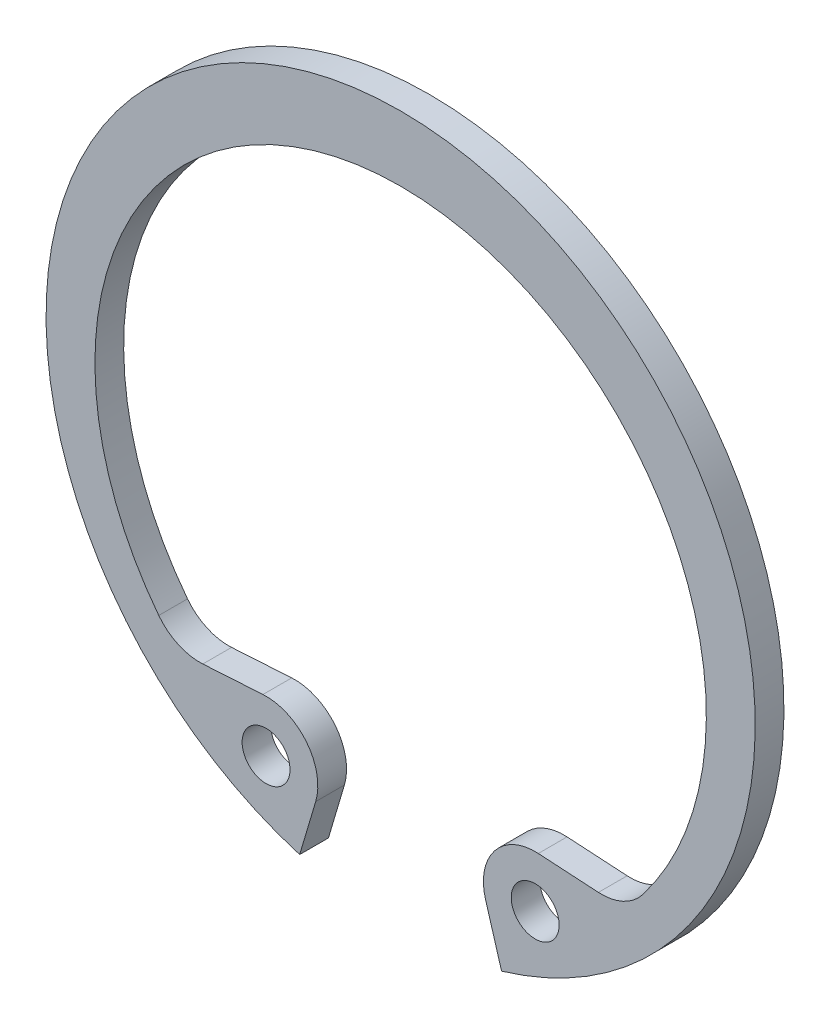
ISO-10303-21;
HEADER;
FILE_DESCRIPTION(('STEP AP214'),'2;1');
FILE_NAME('part.step','',(''),(''),'','','');
FILE_SCHEMA(('AUTOMOTIVE_DESIGN { 1 0 10303 214 1 1 1 1 }'));
ENDSEC;
DATA;
#1=APPLICATION_CONTEXT('core data for automotive mechanical design processes');
#2=APPLICATION_PROTOCOL_DEFINITION('international standard','automotive_design',2000,#1);
#3=PRODUCT_CONTEXT('',#1,'mechanical');
#4=PRODUCT('Part','Part','',(#3));
#5=PRODUCT_RELATED_PRODUCT_CATEGORY('part','',(#4));
#6=PRODUCT_DEFINITION_FORMATION('','',#4);
#7=PRODUCT_DEFINITION_CONTEXT('part definition',#1,'design');
#8=PRODUCT_DEFINITION('design','',#6,#7);
#9=PRODUCT_DEFINITION_SHAPE('','',#8);
#10=(LENGTH_UNIT() NAMED_UNIT(*) SI_UNIT(.MILLI.,.METRE.));
#11=(NAMED_UNIT(*) PLANE_ANGLE_UNIT() SI_UNIT($,.RADIAN.));
#12=(NAMED_UNIT(*) SI_UNIT($,.STERADIAN.) SOLID_ANGLE_UNIT());
#13=UNCERTAINTY_MEASURE_WITH_UNIT(LENGTH_MEASURE(1.E-05),#10,'distance_accuracy_value','');
#14=(GEOMETRIC_REPRESENTATION_CONTEXT(3) GLOBAL_UNCERTAINTY_ASSIGNED_CONTEXT((#13)) GLOBAL_UNIT_ASSIGNED_CONTEXT((#10,
#11,#12)) REPRESENTATION_CONTEXT('',''));
#15=CARTESIAN_POINT('',(0.,0.,0.));
#16=DIRECTION('',(0.,0.,1.));
#17=DIRECTION('',(1.,0.,0.));
#18=AXIS2_PLACEMENT_3D('',#15,#16,#17);
#19=CARTESIAN_POINT('',(0.,0.,1.5));
#20=DIRECTION('',(0.,0.,1.));
#21=DIRECTION('',(1.,0.,0.));
#22=AXIS2_PLACEMENT_3D('',#19,#20,#21);
#23=PLANE('',#22);
#24=CARTESIAN_POINT('',(7.02026616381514,-14.1547116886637,1.5));
#25=DIRECTION('',(0.,0.,1.));
#26=DIRECTION('',(1.,0.,0.));
#27=AXIS2_PLACEMENT_3D('',#24,#25,#26);
#28=CIRCLE('',#27,1.25);
#29=CARTESIAN_POINT('',(8.27026616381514,-14.1547116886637,1.5));
#30=VERTEX_POINT('',#29);
#31=EDGE_CURVE('E128',#30,#30,#28,.T.);
#32=ORIENTED_EDGE('',*,*,#31,.F.);
#33=EDGE_LOOP('',(#32));
#34=FACE_BOUND('',#33,.T.);
#35=CARTESIAN_POINT('',(0.,0.,1.5));
#36=DIRECTION('',(0.,0.,1.));
#37=DIRECTION('',(1.,0.,0.));
#38=AXIS2_PLACEMENT_3D('',#35,#36,#37);
#39=CIRCLE('',#38,18.5);
#40=CARTESIAN_POINT('',(5.26683348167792,-17.7344429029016,1.5));
#41=VERTEX_POINT('',#40);
#42=CARTESIAN_POINT('',(-5.26683348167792,-17.7344429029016,1.5));
#43=VERTEX_POINT('',#42);
#44=EDGE_CURVE('E150',#41,#43,#39,.T.);
#45=ORIENTED_EDGE('',*,*,#44,.T.);
#46=DIRECTION('',(0.284693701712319,0.958618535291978,0.));
#47=VECTOR('',#46,1.);
#48=CARTESIAN_POINT('',(-4.43199611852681,-14.9233846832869,1.5));
#49=LINE('',#48,#47);
#50=CARTESIAN_POINT('',(-4.43199611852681,-14.9233846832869,1.5));
#51=VERTEX_POINT('',#50);
#52=EDGE_CURVE('E123',#43,#51,#49,.T.);
#53=ORIENTED_EDGE('',*,*,#52,.T.);
#54=CARTESIAN_POINT('',(-7.02026616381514,-14.1547116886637,1.5));
#55=DIRECTION('',(0.,0.,1.));
#56=DIRECTION('',(-1.,0.,0.));
#57=AXIS2_PLACEMENT_3D('',#54,#55,#56);
#58=CIRCLE('',#57,2.69999999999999);
#59=CARTESIAN_POINT('',(-7.18319031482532,-11.4596317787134,1.5));
#60=VERTEX_POINT('',#59);
#61=EDGE_CURVE('E153',#51,#60,#58,.T.);
#62=ORIENTED_EDGE('',*,*,#61,.T.);
#63=DIRECTION('',(-0.99817774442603,-0.0603422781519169,0.));
#64=VECTOR('',#63,1.);
#65=CARTESIAN_POINT('',(-10.3196843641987,-11.6492404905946,1.5));
#66=LINE('',#65,#64);
#67=CARTESIAN_POINT('',(-10.3196843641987,-11.6492404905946,1.5));
#68=VERTEX_POINT('',#67);
#69=EDGE_CURVE('E155',#60,#68,#66,.T.);
#70=ORIENTED_EDGE('',*,*,#69,.T.);
#71=CARTESIAN_POINT('',(-10.4826085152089,-8.95416058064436,1.5));
#72=DIRECTION('',(0.,0.,-1.));
#73=DIRECTION('',(-1.,0.,0.));
#74=AXIS2_PLACEMENT_3D('',#71,#72,#73);
#75=CIRCLE('',#74,2.69999999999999);
#76=CARTESIAN_POINT('',(-12.6186872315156,-10.6055744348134,1.5));
#77=VERTEX_POINT('',#76);
#78=EDGE_CURVE('E157',#68,#77,#75,.T.);
#79=ORIENTED_EDGE('',*,*,#78,.T.);
#80=CARTESIAN_POINT('',(0.,-0.85,1.5));
#81=DIRECTION('',(0.,0.,-1.));
#82=DIRECTION('',(1.,0.,0.));
#83=AXIS2_PLACEMENT_3D('',#80,#81,#82);
#84=CIRCLE('',#83,15.95);
#85=CARTESIAN_POINT('',(12.6186872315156,-10.6055744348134,1.5));
#86=VERTEX_POINT('',#85);
#87=EDGE_CURVE('E159',#77,#86,#84,.T.);
#88=ORIENTED_EDGE('',*,*,#87,.T.);
#89=CARTESIAN_POINT('',(10.4826085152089,-8.95416058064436,1.5));
#90=DIRECTION('',(0.,0.,-1.));
#91=DIRECTION('',(1.,0.,0.));
#92=AXIS2_PLACEMENT_3D('',#89,#90,#91);
#93=CIRCLE('',#92,2.69999999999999);
#94=CARTESIAN_POINT('',(10.3196843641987,-11.6492404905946,1.5));
#95=VERTEX_POINT('',#94);
#96=EDGE_CURVE('E161',#86,#95,#93,.T.);
#97=ORIENTED_EDGE('',*,*,#96,.T.);
#98=DIRECTION('',(-0.99817774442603,0.0603422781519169,0.));
#99=VECTOR('',#98,1.);
#100=CARTESIAN_POINT('',(10.3196843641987,-11.6492404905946,1.5));
#101=LINE('',#100,#99);
#102=CARTESIAN_POINT('',(7.18319031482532,-11.4596317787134,1.5));
#103=VERTEX_POINT('',#102);
#104=EDGE_CURVE('E163',#95,#103,#101,.T.);
#105=ORIENTED_EDGE('',*,*,#104,.T.);
#106=CARTESIAN_POINT('',(7.02026616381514,-14.1547116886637,1.5));
#107=DIRECTION('',(0.,0.,1.));
#108=DIRECTION('',(1.,0.,0.));
#109=AXIS2_PLACEMENT_3D('',#106,#107,#108);
#110=CIRCLE('',#109,2.69999999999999);
#111=CARTESIAN_POINT('',(4.43199611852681,-14.9233846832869,1.5));
#112=VERTEX_POINT('',#111);
#113=EDGE_CURVE('E52',#103,#112,#110,.T.);
#114=ORIENTED_EDGE('',*,*,#113,.T.);
#115=DIRECTION('',(0.284693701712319,-0.958618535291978,0.));
#116=VECTOR('',#115,1.);
#117=CARTESIAN_POINT('',(4.43199611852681,-14.9233846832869,1.5));
#118=LINE('',#117,#116);
#119=EDGE_CURVE('E47',#112,#41,#118,.T.);
#120=ORIENTED_EDGE('',*,*,#119,.T.);
#121=EDGE_LOOP('',(#45,#53,#62,#70,#79,#88,#97,#105,#114,#120));
#122=FACE_BOUND('',#121,.T.);
#123=CARTESIAN_POINT('',(-7.02026616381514,-14.1547116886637,1.5));
#124=DIRECTION('',(0.,0.,1.));
#125=DIRECTION('',(-1.,0.,0.));
#126=AXIS2_PLACEMENT_3D('',#123,#124,#125);
#127=CIRCLE('',#126,1.25);
#128=CARTESIAN_POINT('',(-8.27026616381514,-14.1547116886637,1.5));
#129=VERTEX_POINT('',#128);
#130=EDGE_CURVE('E250',#129,#129,#127,.T.);
#131=ORIENTED_EDGE('',*,*,#130,.F.);
#132=EDGE_LOOP('',(#131));
#133=FACE_BOUND('',#132,.T.);
#134=ADVANCED_FACE('F32',(#34,#122,#133),#23,.T.);
#135=CARTESIAN_POINT('',(0.,0.,0.));
#136=DIRECTION('',(0.,0.,1.));
#137=DIRECTION('',(1.,0.,0.));
#138=AXIS2_PLACEMENT_3D('',#135,#136,#137);
#139=PLANE('',#138);
#140=CARTESIAN_POINT('',(7.02026616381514,-14.1547116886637,0.));
#141=DIRECTION('',(0.,0.,1.));
#142=DIRECTION('',(1.,0.,0.));
#143=AXIS2_PLACEMENT_3D('',#140,#141,#142);
#144=CIRCLE('',#143,1.25);
#145=CARTESIAN_POINT('',(8.27026616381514,-14.1547116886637,0.));
#146=VERTEX_POINT('',#145);
#147=EDGE_CURVE('E131',#146,#146,#144,.T.);
#148=ORIENTED_EDGE('',*,*,#147,.T.);
#149=EDGE_LOOP('',(#148));
#150=FACE_BOUND('',#149,.T.);
#151=CARTESIAN_POINT('',(0.,0.,0.));
#152=DIRECTION('',(0.,0.,1.));
#153=DIRECTION('',(1.,0.,0.));
#154=AXIS2_PLACEMENT_3D('',#151,#152,#153);
#155=CIRCLE('',#154,18.5);
#156=CARTESIAN_POINT('',(5.26683348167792,-17.7344429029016,0.));
#157=VERTEX_POINT('',#156);
#158=CARTESIAN_POINT('',(-5.26683348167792,-17.7344429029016,0.));
#159=VERTEX_POINT('',#158);
#160=EDGE_CURVE('E114',#157,#159,#155,.T.);
#161=ORIENTED_EDGE('',*,*,#160,.F.);
#162=DIRECTION('',(0.284693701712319,-0.958618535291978,0.));
#163=VECTOR('',#162,1.);
#164=CARTESIAN_POINT('',(4.43199611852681,-14.9233846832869,0.));
#165=LINE('',#164,#163);
#166=CARTESIAN_POINT('',(4.43199611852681,-14.9233846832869,0.));
#167=VERTEX_POINT('',#166);
#168=EDGE_CURVE('E148',#167,#157,#165,.T.);
#169=ORIENTED_EDGE('',*,*,#168,.F.);
#170=CARTESIAN_POINT('',(7.02026616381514,-14.1547116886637,0.));
#171=DIRECTION('',(0.,0.,1.));
#172=DIRECTION('',(1.,0.,0.));
#173=AXIS2_PLACEMENT_3D('',#170,#171,#172);
#174=CIRCLE('',#173,2.69999999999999);
#175=CARTESIAN_POINT('',(7.18319031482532,-11.4596317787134,0.));
#176=VERTEX_POINT('',#175);
#177=EDGE_CURVE('E146',#176,#167,#174,.T.);
#178=ORIENTED_EDGE('',*,*,#177,.F.);
#179=DIRECTION('',(-0.99817774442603,0.0603422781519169,0.));
#180=VECTOR('',#179,1.);
#181=CARTESIAN_POINT('',(10.3196843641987,-11.6492404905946,0.));
#182=LINE('',#181,#180);
#183=CARTESIAN_POINT('',(10.3196843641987,-11.6492404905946,0.));
#184=VERTEX_POINT('',#183);
#185=EDGE_CURVE('E144',#184,#176,#182,.T.);
#186=ORIENTED_EDGE('',*,*,#185,.F.);
#187=CARTESIAN_POINT('',(10.4826085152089,-8.95416058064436,0.));
#188=DIRECTION('',(0.,0.,-1.));
#189=DIRECTION('',(1.,0.,0.));
#190=AXIS2_PLACEMENT_3D('',#187,#188,#189);
#191=CIRCLE('',#190,2.69999999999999);
#192=CARTESIAN_POINT('',(12.6186872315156,-10.6055744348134,0.));
#193=VERTEX_POINT('',#192);
#194=EDGE_CURVE('E142',#193,#184,#191,.T.);
#195=ORIENTED_EDGE('',*,*,#194,.F.);
#196=CARTESIAN_POINT('',(0.,-0.85,0.));
#197=DIRECTION('',(0.,0.,-1.));
#198=DIRECTION('',(1.,0.,0.));
#199=AXIS2_PLACEMENT_3D('',#196,#197,#198);
#200=CIRCLE('',#199,15.95);
#201=CARTESIAN_POINT('',(-12.6186872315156,-10.6055744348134,0.));
#202=VERTEX_POINT('',#201);
#203=EDGE_CURVE('E140',#202,#193,#200,.T.);
#204=ORIENTED_EDGE('',*,*,#203,.F.);
#205=CARTESIAN_POINT('',(-10.4826085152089,-8.95416058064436,0.));
#206=DIRECTION('',(0.,0.,-1.));
#207=DIRECTION('',(-1.,0.,0.));
#208=AXIS2_PLACEMENT_3D('',#205,#206,#207);
#209=CIRCLE('',#208,2.69999999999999);
#210=CARTESIAN_POINT('',(-10.3196843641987,-11.6492404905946,0.));
#211=VERTEX_POINT('',#210);
#212=EDGE_CURVE('E138',#211,#202,#209,.T.);
#213=ORIENTED_EDGE('',*,*,#212,.F.);
#214=DIRECTION('',(-0.99817774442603,-0.0603422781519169,0.));
#215=VECTOR('',#214,1.);
#216=CARTESIAN_POINT('',(-10.3196843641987,-11.6492404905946,0.));
#217=LINE('',#216,#215);
#218=CARTESIAN_POINT('',(-7.18319031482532,-11.4596317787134,0.));
#219=VERTEX_POINT('',#218);
#220=EDGE_CURVE('E136',#219,#211,#217,.T.);
#221=ORIENTED_EDGE('',*,*,#220,.F.);
#222=CARTESIAN_POINT('',(-7.02026616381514,-14.1547116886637,0.));
#223=DIRECTION('',(0.,0.,1.));
#224=DIRECTION('',(-1.,0.,0.));
#225=AXIS2_PLACEMENT_3D('',#222,#223,#224);
#226=CIRCLE('',#225,2.69999999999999);
#227=CARTESIAN_POINT('',(-4.43199611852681,-14.9233846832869,0.));
#228=VERTEX_POINT('',#227);
#229=EDGE_CURVE('E116',#228,#219,#226,.T.);
#230=ORIENTED_EDGE('',*,*,#229,.F.);
#231=DIRECTION('',(0.284693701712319,0.958618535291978,0.));
#232=VECTOR('',#231,1.);
#233=CARTESIAN_POINT('',(-4.43199611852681,-14.9233846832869,0.));
#234=LINE('',#233,#232);
#235=EDGE_CURVE('E109',#159,#228,#234,.T.);
#236=ORIENTED_EDGE('',*,*,#235,.F.);
#237=EDGE_LOOP('',(#161,#169,#178,#186,#195,#204,#213,#221,#230,#236));
#238=FACE_BOUND('',#237,.T.);
#239=CARTESIAN_POINT('',(-7.02026616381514,-14.1547116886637,0.));
#240=DIRECTION('',(0.,0.,1.));
#241=DIRECTION('',(-1.,0.,0.));
#242=AXIS2_PLACEMENT_3D('',#239,#240,#241);
#243=CIRCLE('',#242,1.25);
#244=CARTESIAN_POINT('',(-8.27026616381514,-14.1547116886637,0.));
#245=VERTEX_POINT('',#244);
#246=EDGE_CURVE('E253',#245,#245,#243,.T.);
#247=ORIENTED_EDGE('',*,*,#246,.T.);
#248=EDGE_LOOP('',(#247));
#249=FACE_BOUND('',#248,.T.);
#250=ADVANCED_FACE('F110',(#150,#238,#249),#139,.F.);
#251=CARTESIAN_POINT('',(0.,0.,1.5));
#252=DIRECTION('',(0.,0.,-1.));
#253=DIRECTION('',(-1.,0.,0.));
#254=AXIS2_PLACEMENT_3D('',#251,#252,#253);
#255=CYLINDRICAL_SURFACE('',#254,18.5);
#256=ORIENTED_EDGE('',*,*,#160,.T.);
#257=DIRECTION('',(0.,0.,-1.));
#258=VECTOR('',#257,1.);
#259=CARTESIAN_POINT('',(-5.26683348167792,-17.7344429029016,1.5));
#260=LINE('',#259,#258);
#261=EDGE_CURVE('E11',#43,#159,#260,.T.);
#262=ORIENTED_EDGE('',*,*,#261,.F.);
#263=ORIENTED_EDGE('',*,*,#44,.F.);
#264=DIRECTION('',(0.,0.,-1.));
#265=VECTOR('',#264,1.);
#266=CARTESIAN_POINT('',(5.26683348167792,-17.7344429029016,1.5));
#267=LINE('',#266,#265);
#268=EDGE_CURVE('E127',#41,#157,#267,.T.);
#269=ORIENTED_EDGE('',*,*,#268,.T.);
#270=EDGE_LOOP('',(#256,#262,#263,#269));
#271=FACE_BOUND('',#270,.T.);
#272=ADVANCED_FACE('F34',(#271),#255,.T.);
#273=CARTESIAN_POINT('',(-4.43199611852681,-14.9233846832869,1.5));
#274=DIRECTION('',(-0.958618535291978,0.284693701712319,0.));
#275=DIRECTION('',(-0.284693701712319,-0.958618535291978,0.));
#276=AXIS2_PLACEMENT_3D('',#273,#274,#275);
#277=PLANE('',#276);
#278=ORIENTED_EDGE('',*,*,#235,.T.);
#279=DIRECTION('',(0.,0.,-1.));
#280=VECTOR('',#279,1.);
#281=CARTESIAN_POINT('',(-4.43199611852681,-14.9233846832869,1.5));
#282=LINE('',#281,#280);
#283=EDGE_CURVE('E40',#51,#228,#282,.T.);
#284=ORIENTED_EDGE('',*,*,#283,.F.);
#285=ORIENTED_EDGE('',*,*,#52,.F.);
#286=ORIENTED_EDGE('',*,*,#261,.T.);
#287=EDGE_LOOP('',(#278,#284,#285,#286));
#288=FACE_BOUND('',#287,.T.);
#289=ADVANCED_FACE('F122',(#288),#277,.F.);
#290=CARTESIAN_POINT('',(-7.02026616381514,-14.1547116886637,1.5));
#291=DIRECTION('',(0.,0.,-1.));
#292=DIRECTION('',(-1.,0.,0.));
#293=AXIS2_PLACEMENT_3D('',#290,#291,#292);
#294=CYLINDRICAL_SURFACE('',#293,2.69999999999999);
#295=ORIENTED_EDGE('',*,*,#229,.T.);
#296=DIRECTION('',(0.,0.,-1.));
#297=VECTOR('',#296,1.);
#298=CARTESIAN_POINT('',(-7.18319031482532,-11.4596317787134,1.5));
#299=LINE('',#298,#297);
#300=EDGE_CURVE('E186',#60,#219,#299,.T.);
#301=ORIENTED_EDGE('',*,*,#300,.F.);
#302=ORIENTED_EDGE('',*,*,#61,.F.);
#303=ORIENTED_EDGE('',*,*,#283,.T.);
#304=EDGE_LOOP('',(#295,#301,#302,#303));
#305=FACE_BOUND('',#304,.T.);
#306=ADVANCED_FACE('F190',(#305),#294,.T.);
#307=CARTESIAN_POINT('',(-10.3196843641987,-11.6492404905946,1.5));
#308=DIRECTION('',(0.0603422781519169,-0.99817774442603,0.));
#309=DIRECTION('',(0.99817774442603,0.0603422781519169,0.));
#310=AXIS2_PLACEMENT_3D('',#307,#308,#309);
#311=PLANE('',#310);
#312=ORIENTED_EDGE('',*,*,#220,.T.);
#313=DIRECTION('',(0.,0.,-1.));
#314=VECTOR('',#313,1.);
#315=CARTESIAN_POINT('',(-10.3196843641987,-11.6492404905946,1.5));
#316=LINE('',#315,#314);
#317=EDGE_CURVE('E183',#68,#211,#316,.T.);
#318=ORIENTED_EDGE('',*,*,#317,.F.);
#319=ORIENTED_EDGE('',*,*,#69,.F.);
#320=ORIENTED_EDGE('',*,*,#300,.T.);
#321=EDGE_LOOP('',(#312,#318,#319,#320));
#322=FACE_BOUND('',#321,.T.);
#323=ADVANCED_FACE('F198',(#322),#311,.F.);
#324=CARTESIAN_POINT('',(-10.4826085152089,-8.95416058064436,1.5));
#325=DIRECTION('',(0.,0.,-1.));
#326=DIRECTION('',(-1.,0.,0.));
#327=AXIS2_PLACEMENT_3D('',#324,#325,#326);
#328=CYLINDRICAL_SURFACE('',#327,2.69999999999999);
#329=ORIENTED_EDGE('',*,*,#212,.T.);
#330=DIRECTION('',(0.,0.,-1.));
#331=VECTOR('',#330,1.);
#332=CARTESIAN_POINT('',(-12.6186872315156,-10.6055744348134,1.5));
#333=LINE('',#332,#331);
#334=EDGE_CURVE('E180',#77,#202,#333,.T.);
#335=ORIENTED_EDGE('',*,*,#334,.F.);
#336=ORIENTED_EDGE('',*,*,#78,.F.);
#337=ORIENTED_EDGE('',*,*,#317,.T.);
#338=EDGE_LOOP('',(#329,#335,#336,#337));
#339=FACE_BOUND('',#338,.T.);
#340=ADVANCED_FACE('F201',(#339),#328,.F.);
#341=CARTESIAN_POINT('',(0.,-0.85,1.5));
#342=DIRECTION('',(0.,0.,-1.));
#343=DIRECTION('',(-1.,0.,0.));
#344=AXIS2_PLACEMENT_3D('',#341,#342,#343);
#345=CYLINDRICAL_SURFACE('',#344,15.95);
#346=ORIENTED_EDGE('',*,*,#203,.T.);
#347=DIRECTION('',(0.,0.,-1.));
#348=VECTOR('',#347,1.);
#349=CARTESIAN_POINT('',(12.6186872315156,-10.6055744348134,1.5));
#350=LINE('',#349,#348);
#351=EDGE_CURVE('E177',#86,#193,#350,.T.);
#352=ORIENTED_EDGE('',*,*,#351,.F.);
#353=ORIENTED_EDGE('',*,*,#87,.F.);
#354=ORIENTED_EDGE('',*,*,#334,.T.);
#355=EDGE_LOOP('',(#346,#352,#353,#354));
#356=FACE_BOUND('',#355,.T.);
#357=ADVANCED_FACE('F206',(#356),#345,.F.);
#358=CARTESIAN_POINT('',(10.4826085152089,-8.95416058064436,1.5));
#359=DIRECTION('',(0.,0.,-1.));
#360=DIRECTION('',(-1.,0.,0.));
#361=AXIS2_PLACEMENT_3D('',#358,#359,#360);
#362=CYLINDRICAL_SURFACE('',#361,2.69999999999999);
#363=ORIENTED_EDGE('',*,*,#194,.T.);
#364=DIRECTION('',(0.,0.,-1.));
#365=VECTOR('',#364,1.);
#366=CARTESIAN_POINT('',(10.3196843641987,-11.6492404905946,1.5));
#367=LINE('',#366,#365);
#368=EDGE_CURVE('E174',#95,#184,#367,.T.);
#369=ORIENTED_EDGE('',*,*,#368,.F.);
#370=ORIENTED_EDGE('',*,*,#96,.F.);
#371=ORIENTED_EDGE('',*,*,#351,.T.);
#372=EDGE_LOOP('',(#363,#369,#370,#371));
#373=FACE_BOUND('',#372,.T.);
#374=ADVANCED_FACE('F212',(#373),#362,.F.);
#375=CARTESIAN_POINT('',(10.3196843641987,-11.6492404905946,1.5));
#376=DIRECTION('',(-0.0603422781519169,-0.99817774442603,0.));
#377=DIRECTION('',(0.99817774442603,-0.0603422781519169,0.));
#378=AXIS2_PLACEMENT_3D('',#375,#376,#377);
#379=PLANE('',#378);
#380=ORIENTED_EDGE('',*,*,#185,.T.);
#381=DIRECTION('',(0.,0.,-1.));
#382=VECTOR('',#381,1.);
#383=CARTESIAN_POINT('',(7.18319031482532,-11.4596317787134,1.5));
#384=LINE('',#383,#382);
#385=EDGE_CURVE('E171',#103,#176,#384,.T.);
#386=ORIENTED_EDGE('',*,*,#385,.F.);
#387=ORIENTED_EDGE('',*,*,#104,.F.);
#388=ORIENTED_EDGE('',*,*,#368,.T.);
#389=EDGE_LOOP('',(#380,#386,#387,#388));
#390=FACE_BOUND('',#389,.T.);
#391=ADVANCED_FACE('F216',(#390),#379,.F.);
#392=CARTESIAN_POINT('',(7.02026616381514,-14.1547116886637,1.5));
#393=DIRECTION('',(0.,0.,-1.));
#394=DIRECTION('',(-1.,0.,0.));
#395=AXIS2_PLACEMENT_3D('',#392,#393,#394);
#396=CYLINDRICAL_SURFACE('',#395,2.69999999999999);
#397=ORIENTED_EDGE('',*,*,#177,.T.);
#398=DIRECTION('',(0.,0.,-1.));
#399=VECTOR('',#398,1.);
#400=CARTESIAN_POINT('',(4.43199611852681,-14.9233846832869,1.5));
#401=LINE('',#400,#399);
#402=EDGE_CURVE('E168',#112,#167,#401,.T.);
#403=ORIENTED_EDGE('',*,*,#402,.F.);
#404=ORIENTED_EDGE('',*,*,#113,.F.);
#405=ORIENTED_EDGE('',*,*,#385,.T.);
#406=EDGE_LOOP('',(#397,#403,#404,#405));
#407=FACE_BOUND('',#406,.T.);
#408=ADVANCED_FACE('F219',(#407),#396,.T.);
#409=CARTESIAN_POINT('',(4.43199611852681,-14.9233846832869,1.5));
#410=DIRECTION('',(0.958618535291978,0.284693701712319,0.));
#411=DIRECTION('',(-0.284693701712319,0.958618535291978,0.));
#412=AXIS2_PLACEMENT_3D('',#409,#410,#411);
#413=PLANE('',#412);
#414=ORIENTED_EDGE('',*,*,#168,.T.);
#415=ORIENTED_EDGE('',*,*,#268,.F.);
#416=ORIENTED_EDGE('',*,*,#119,.F.);
#417=ORIENTED_EDGE('',*,*,#402,.T.);
#418=EDGE_LOOP('',(#414,#415,#416,#417));
#419=FACE_BOUND('',#418,.T.);
#420=ADVANCED_FACE('F221',(#419),#413,.F.);
#421=CARTESIAN_POINT('',(7.02026616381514,-14.1547116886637,1.5));
#422=DIRECTION('',(0.,0.,-1.));
#423=DIRECTION('',(-1.,0.,0.));
#424=AXIS2_PLACEMENT_3D('',#421,#422,#423);
#425=CYLINDRICAL_SURFACE('',#424,1.25);
#426=ORIENTED_EDGE('',*,*,#31,.T.);
#427=EDGE_LOOP('',(#426));
#428=FACE_BOUND('',#427,.T.);
#429=ORIENTED_EDGE('',*,*,#147,.F.);
#430=EDGE_LOOP('',(#429));
#431=FACE_BOUND('',#430,.T.);
#432=ADVANCED_FACE('F223',(#428,#431),#425,.F.);
#433=CARTESIAN_POINT('',(-7.02026616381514,-14.1547116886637,1.5));
#434=DIRECTION('',(0.,0.,-1.));
#435=DIRECTION('',(-1.,0.,0.));
#436=AXIS2_PLACEMENT_3D('',#433,#434,#435);
#437=CYLINDRICAL_SURFACE('',#436,1.25);
#438=ORIENTED_EDGE('',*,*,#130,.T.);
#439=EDGE_LOOP('',(#438));
#440=FACE_BOUND('',#439,.T.);
#441=ORIENTED_EDGE('',*,*,#246,.F.);
#442=EDGE_LOOP('',(#441));
#443=FACE_BOUND('',#442,.T.);
#444=ADVANCED_FACE('F229',(#440,#443),#437,.F.);
#445=CLOSED_SHELL('',(#134,#250,#272,#289,#306,#323,#340,#357,#374,#391,#408,#420,#432,#444));
#446=MANIFOLD_SOLID_BREP('B2',#445);
#447=ADVANCED_BREP_SHAPE_REPRESENTATION('',(#18,#446),#14);
#448=SHAPE_DEFINITION_REPRESENTATION(#9,#447);
ENDSEC;
END-ISO-10303-21;
